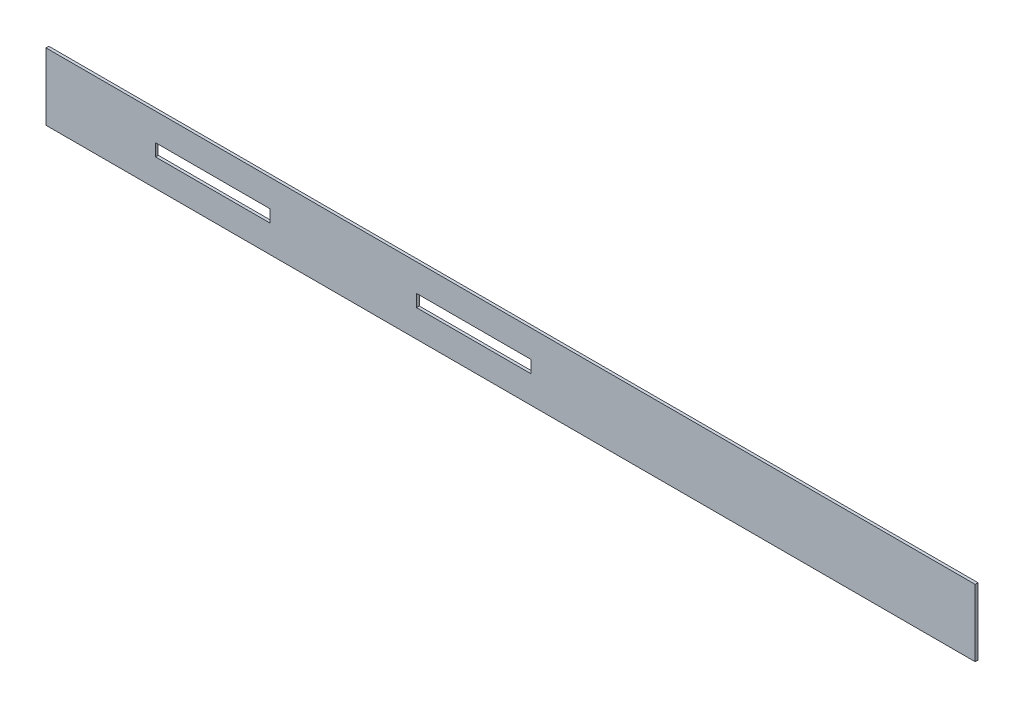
ISO-10303-21;
HEADER;
FILE_DESCRIPTION(('STEP AP214'),'2;1');
FILE_NAME('part.step','',(''),(''),'','','');
FILE_SCHEMA(('AUTOMOTIVE_DESIGN { 1 0 10303 214 1 1 1 1 }'));
ENDSEC;
DATA;
#1=APPLICATION_CONTEXT('core data for automotive mechanical design processes');
#2=APPLICATION_PROTOCOL_DEFINITION('international standard','automotive_design',2000,#1);
#3=PRODUCT_CONTEXT('',#1,'mechanical');
#4=PRODUCT('Part','Part','',(#3));
#5=PRODUCT_RELATED_PRODUCT_CATEGORY('part','',(#4));
#6=PRODUCT_DEFINITION_FORMATION('','',#4);
#7=PRODUCT_DEFINITION_CONTEXT('part definition',#1,'design');
#8=PRODUCT_DEFINITION('design','',#6,#7);
#9=PRODUCT_DEFINITION_SHAPE('','',#8);
#10=(LENGTH_UNIT() NAMED_UNIT(*) SI_UNIT(.MILLI.,.METRE.));
#11=(NAMED_UNIT(*) PLANE_ANGLE_UNIT() SI_UNIT($,.RADIAN.));
#12=(NAMED_UNIT(*) SI_UNIT($,.STERADIAN.) SOLID_ANGLE_UNIT());
#13=UNCERTAINTY_MEASURE_WITH_UNIT(LENGTH_MEASURE(1.E-05),#10,'distance_accuracy_value','');
#14=(GEOMETRIC_REPRESENTATION_CONTEXT(3) GLOBAL_UNCERTAINTY_ASSIGNED_CONTEXT((#13)) GLOBAL_UNIT_ASSIGNED_CONTEXT((#10,
#11,#12)) REPRESENTATION_CONTEXT('',''));
#15=CARTESIAN_POINT('',(0.,0.,0.));
#16=DIRECTION('',(0.,0.,1.));
#17=DIRECTION('',(1.,0.,0.));
#18=AXIS2_PLACEMENT_3D('',#15,#16,#17);
#19=CARTESIAN_POINT('',(-1417.10462608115,404.534646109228,8.));
#20=DIRECTION('',(1.,0.,0.));
#21=DIRECTION('',(0.,0.,-1.));
#22=AXIS2_PLACEMENT_3D('',#19,#20,#21);
#23=PLANE('',#22);
#24=DIRECTION('',(0.,-1.,0.));
#25=VECTOR('',#24,1.);
#26=CARTESIAN_POINT('',(-1417.10462608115,404.534646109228,0.));
#27=LINE('',#26,#25);
#28=CARTESIAN_POINT('',(-1417.10462608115,404.534646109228,0.));
#29=VERTEX_POINT('',#28);
#30=CARTESIAN_POINT('',(-1417.10462608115,214.534646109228,0.));
#31=VERTEX_POINT('',#30);
#32=EDGE_CURVE('E181',#29,#31,#27,.T.);
#33=ORIENTED_EDGE('',*,*,#32,.T.);
#34=DIRECTION('',(0.,0.,-1.));
#35=VECTOR('',#34,1.);
#36=CARTESIAN_POINT('',(-1417.10462608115,214.534646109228,8.));
#37=LINE('',#36,#35);
#38=CARTESIAN_POINT('',(-1417.10462608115,214.534646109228,8.));
#39=VERTEX_POINT('',#38);
#40=EDGE_CURVE('E11',#39,#31,#37,.T.);
#41=ORIENTED_EDGE('',*,*,#40,.F.);
#42=DIRECTION('',(0.,-1.,0.));
#43=VECTOR('',#42,1.);
#44=CARTESIAN_POINT('',(-1417.10462608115,404.534646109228,8.));
#45=LINE('',#44,#43);
#46=CARTESIAN_POINT('',(-1417.10462608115,404.534646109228,8.));
#47=VERTEX_POINT('',#46);
#48=EDGE_CURVE('E188',#47,#39,#45,.T.);
#49=ORIENTED_EDGE('',*,*,#48,.F.);
#50=DIRECTION('',(0.,0.,-1.));
#51=VECTOR('',#50,1.);
#52=CARTESIAN_POINT('',(-1417.10462608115,404.534646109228,8.));
#53=LINE('',#52,#51);
#54=EDGE_CURVE('E198',#47,#29,#53,.T.);
#55=ORIENTED_EDGE('',*,*,#54,.T.);
#56=EDGE_LOOP('',(#33,#41,#49,#55));
#57=FACE_BOUND('',#56,.T.);
#58=ADVANCED_FACE('F31',(#57),#23,.F.);
#59=CARTESIAN_POINT('',(-1417.10462608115,214.534646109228,8.));
#60=DIRECTION('',(0.,1.,0.));
#61=DIRECTION('',(0.,0.,1.));
#62=AXIS2_PLACEMENT_3D('',#59,#60,#61);
#63=PLANE('',#62);
#64=DIRECTION('',(1.,0.,0.));
#65=VECTOR('',#64,1.);
#66=CARTESIAN_POINT('',(-1417.10462608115,214.534646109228,0.));
#67=LINE('',#66,#65);
#68=CARTESIAN_POINT('',(1215.89537391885,214.534646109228,0.));
#69=VERTEX_POINT('',#68);
#70=EDGE_CURVE('E201',#31,#69,#67,.T.);
#71=ORIENTED_EDGE('',*,*,#70,.T.);
#72=DIRECTION('',(0.,0.,-1.));
#73=VECTOR('',#72,1.);
#74=CARTESIAN_POINT('',(1215.89537391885,214.534646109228,8.));
#75=LINE('',#74,#73);
#76=CARTESIAN_POINT('',(1215.89537391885,214.534646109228,8.));
#77=VERTEX_POINT('',#76);
#78=EDGE_CURVE('E38',#77,#69,#75,.T.);
#79=ORIENTED_EDGE('',*,*,#78,.F.);
#80=DIRECTION('',(1.,0.,0.));
#81=VECTOR('',#80,1.);
#82=CARTESIAN_POINT('',(-1417.10462608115,214.534646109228,8.));
#83=LINE('',#82,#81);
#84=EDGE_CURVE('E191',#39,#77,#83,.T.);
#85=ORIENTED_EDGE('',*,*,#84,.F.);
#86=ORIENTED_EDGE('',*,*,#40,.T.);
#87=EDGE_LOOP('',(#71,#79,#85,#86));
#88=FACE_BOUND('',#87,.T.);
#89=ADVANCED_FACE('F230',(#88),#63,.F.);
#90=CARTESIAN_POINT('',(1215.89537391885,404.534646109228,8.));
#91=DIRECTION('',(-1.,0.,0.));
#92=DIRECTION('',(0.,0.,1.));
#93=AXIS2_PLACEMENT_3D('',#90,#91,#92);
#94=PLANE('',#93);
#95=DIRECTION('',(0.,1.,0.));
#96=VECTOR('',#95,1.);
#97=CARTESIAN_POINT('',(1215.89537391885,404.534646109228,0.));
#98=LINE('',#97,#96);
#99=CARTESIAN_POINT('',(1215.89537391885,404.534646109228,0.));
#100=VERTEX_POINT('',#99);
#101=EDGE_CURVE('E203',#69,#100,#98,.T.);
#102=ORIENTED_EDGE('',*,*,#101,.T.);
#103=DIRECTION('',(0.,0.,-1.));
#104=VECTOR('',#103,1.);
#105=CARTESIAN_POINT('',(1215.89537391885,404.534646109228,8.));
#106=LINE('',#105,#104);
#107=CARTESIAN_POINT('',(1215.89537391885,404.534646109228,8.));
#108=VERTEX_POINT('',#107);
#109=EDGE_CURVE('E208',#108,#100,#106,.T.);
#110=ORIENTED_EDGE('',*,*,#109,.F.);
#111=DIRECTION('',(0.,1.,0.));
#112=VECTOR('',#111,1.);
#113=CARTESIAN_POINT('',(1215.89537391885,404.534646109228,8.));
#114=LINE('',#113,#112);
#115=EDGE_CURVE('E194',#77,#108,#114,.T.);
#116=ORIENTED_EDGE('',*,*,#115,.F.);
#117=ORIENTED_EDGE('',*,*,#78,.T.);
#118=EDGE_LOOP('',(#102,#110,#116,#117));
#119=FACE_BOUND('',#118,.T.);
#120=ADVANCED_FACE('F215',(#119),#94,.F.);
#121=CARTESIAN_POINT('',(-1417.10462608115,404.534646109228,8.));
#122=DIRECTION('',(0.,-1.,0.));
#123=DIRECTION('',(0.,0.,-1.));
#124=AXIS2_PLACEMENT_3D('',#121,#122,#123);
#125=PLANE('',#124);
#126=DIRECTION('',(-1.,0.,0.));
#127=VECTOR('',#126,1.);
#128=CARTESIAN_POINT('',(-1417.10462608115,404.534646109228,0.));
#129=LINE('',#128,#127);
#130=EDGE_CURVE('E192',#100,#29,#129,.T.);
#131=ORIENTED_EDGE('',*,*,#130,.T.);
#132=ORIENTED_EDGE('',*,*,#54,.F.);
#133=DIRECTION('',(-1.,0.,0.));
#134=VECTOR('',#133,1.);
#135=CARTESIAN_POINT('',(-1417.10462608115,404.534646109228,8.));
#136=LINE('',#135,#134);
#137=EDGE_CURVE('E196',#108,#47,#136,.T.);
#138=ORIENTED_EDGE('',*,*,#137,.F.);
#139=ORIENTED_EDGE('',*,*,#109,.T.);
#140=EDGE_LOOP('',(#131,#132,#138,#139));
#141=FACE_BOUND('',#140,.T.);
#142=ADVANCED_FACE('F223',(#141),#125,.F.);
#143=CARTESIAN_POINT('',(-1417.10462608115,214.534646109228,8.));
#144=DIRECTION('',(0.,0.,1.));
#145=DIRECTION('',(1.,0.,0.));
#146=AXIS2_PLACEMENT_3D('',#143,#144,#145);
#147=PLANE('',#146);
#148=DIRECTION('',(0.,1.,0.));
#149=VECTOR('',#148,1.);
#150=CARTESIAN_POINT('',(-42.1046260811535,292.034646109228,8.));
#151=LINE('',#150,#149);
#152=CARTESIAN_POINT('',(-42.1046260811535,292.034646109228,8.));
#153=VERTEX_POINT('',#152);
#154=CARTESIAN_POINT('',(-42.1046260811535,327.034646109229,8.));
#155=VERTEX_POINT('',#154);
#156=EDGE_CURVE('E45',#153,#155,#151,.T.);
#157=ORIENTED_EDGE('',*,*,#156,.F.);
#158=DIRECTION('',(1.,0.,0.));
#159=VECTOR('',#158,1.);
#160=CARTESIAN_POINT('',(-42.1046260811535,292.034646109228,8.));
#161=LINE('',#160,#159);
#162=CARTESIAN_POINT('',(-367.104626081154,292.034646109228,8.));
#163=VERTEX_POINT('',#162);
#164=EDGE_CURVE('E137',#163,#153,#161,.T.);
#165=ORIENTED_EDGE('',*,*,#164,.F.);
#166=DIRECTION('',(0.,-1.,0.));
#167=VECTOR('',#166,1.);
#168=CARTESIAN_POINT('',(-367.104626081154,292.034646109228,8.));
#169=LINE('',#168,#167);
#170=CARTESIAN_POINT('',(-367.104626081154,327.034646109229,8.));
#171=VERTEX_POINT('',#170);
#172=EDGE_CURVE('E140',#171,#163,#169,.T.);
#173=ORIENTED_EDGE('',*,*,#172,.F.);
#174=DIRECTION('',(-1.,0.,0.));
#175=VECTOR('',#174,1.);
#176=CARTESIAN_POINT('',(-42.1046260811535,327.034646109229,8.));
#177=LINE('',#176,#175);
#178=EDGE_CURVE('E146',#155,#171,#177,.T.);
#179=ORIENTED_EDGE('',*,*,#178,.F.);
#180=EDGE_LOOP('',(#157,#165,#173,#179));
#181=FACE_BOUND('',#180,.T.);
#182=DIRECTION('',(0.,1.,0.));
#183=VECTOR('',#182,1.);
#184=CARTESIAN_POINT('',(-782.104626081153,327.034646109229,8.));
#185=LINE('',#184,#183);
#186=CARTESIAN_POINT('',(-782.104626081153,292.034646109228,8.));
#187=VERTEX_POINT('',#186);
#188=CARTESIAN_POINT('',(-782.104626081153,327.034646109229,8.));
#189=VERTEX_POINT('',#188);
#190=EDGE_CURVE('E152',#187,#189,#185,.T.);
#191=ORIENTED_EDGE('',*,*,#190,.F.);
#192=DIRECTION('',(1.,0.,0.));
#193=VECTOR('',#192,1.);
#194=CARTESIAN_POINT('',(-782.104626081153,292.034646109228,8.));
#195=LINE('',#194,#193);
#196=CARTESIAN_POINT('',(-1107.10462608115,292.034646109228,8.));
#197=VERTEX_POINT('',#196);
#198=EDGE_CURVE('E160',#197,#187,#195,.T.);
#199=ORIENTED_EDGE('',*,*,#198,.F.);
#200=DIRECTION('',(0.,-1.,0.));
#201=VECTOR('',#200,1.);
#202=CARTESIAN_POINT('',(-1107.10462608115,327.034646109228,8.));
#203=LINE('',#202,#201);
#204=CARTESIAN_POINT('',(-1107.10462608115,327.034646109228,8.));
#205=VERTEX_POINT('',#204);
#206=EDGE_CURVE('E174',#205,#197,#203,.T.);
#207=ORIENTED_EDGE('',*,*,#206,.F.);
#208=DIRECTION('',(-1.,0.,0.));
#209=VECTOR('',#208,1.);
#210=CARTESIAN_POINT('',(-782.104626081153,327.034646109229,8.));
#211=LINE('',#210,#209);
#212=EDGE_CURVE('E171',#189,#205,#211,.T.);
#213=ORIENTED_EDGE('',*,*,#212,.F.);
#214=EDGE_LOOP('',(#191,#199,#207,#213));
#215=FACE_BOUND('',#214,.T.);
#216=ORIENTED_EDGE('',*,*,#48,.T.);
#217=ORIENTED_EDGE('',*,*,#84,.T.);
#218=ORIENTED_EDGE('',*,*,#115,.T.);
#219=ORIENTED_EDGE('',*,*,#137,.T.);
#220=EDGE_LOOP('',(#216,#217,#218,#219));
#221=FACE_BOUND('',#220,.T.);
#222=ADVANCED_FACE('F229',(#181,#215,#221),#147,.T.);
#223=CARTESIAN_POINT('',(-1417.10462608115,214.534646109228,0.));
#224=DIRECTION('',(0.,0.,1.));
#225=DIRECTION('',(1.,0.,0.));
#226=AXIS2_PLACEMENT_3D('',#223,#224,#225);
#227=PLANE('',#226);
#228=DIRECTION('',(1.,0.,0.));
#229=VECTOR('',#228,1.);
#230=CARTESIAN_POINT('',(-42.1046260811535,292.034646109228,0.));
#231=LINE('',#230,#229);
#232=CARTESIAN_POINT('',(-367.104626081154,292.034646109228,0.));
#233=VERTEX_POINT('',#232);
#234=CARTESIAN_POINT('',(-42.1046260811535,292.034646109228,0.));
#235=VERTEX_POINT('',#234);
#236=EDGE_CURVE('E127',#233,#235,#231,.T.);
#237=ORIENTED_EDGE('',*,*,#236,.T.);
#238=DIRECTION('',(0.,1.,0.));
#239=VECTOR('',#238,1.);
#240=CARTESIAN_POINT('',(-42.1046260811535,292.034646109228,0.));
#241=LINE('',#240,#239);
#242=CARTESIAN_POINT('',(-42.1046260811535,327.034646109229,0.));
#243=VERTEX_POINT('',#242);
#244=EDGE_CURVE('E121',#235,#243,#241,.T.);
#245=ORIENTED_EDGE('',*,*,#244,.T.);
#246=DIRECTION('',(-1.,0.,0.));
#247=VECTOR('',#246,1.);
#248=CARTESIAN_POINT('',(-42.1046260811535,327.034646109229,0.));
#249=LINE('',#248,#247);
#250=CARTESIAN_POINT('',(-367.104626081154,327.034646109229,0.));
#251=VERTEX_POINT('',#250);
#252=EDGE_CURVE('E130',#243,#251,#249,.T.);
#253=ORIENTED_EDGE('',*,*,#252,.T.);
#254=DIRECTION('',(0.,-1.,0.));
#255=VECTOR('',#254,1.);
#256=CARTESIAN_POINT('',(-367.104626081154,292.034646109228,0.));
#257=LINE('',#256,#255);
#258=EDGE_CURVE('E53',#251,#233,#257,.T.);
#259=ORIENTED_EDGE('',*,*,#258,.T.);
#260=EDGE_LOOP('',(#237,#245,#253,#259));
#261=FACE_BOUND('',#260,.T.);
#262=DIRECTION('',(1.,0.,0.));
#263=VECTOR('',#262,1.);
#264=CARTESIAN_POINT('',(-782.104626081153,292.034646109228,0.));
#265=LINE('',#264,#263);
#266=CARTESIAN_POINT('',(-1107.10462608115,292.034646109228,0.));
#267=VERTEX_POINT('',#266);
#268=CARTESIAN_POINT('',(-782.104626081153,292.034646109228,0.));
#269=VERTEX_POINT('',#268);
#270=EDGE_CURVE('E166',#267,#269,#265,.T.);
#271=ORIENTED_EDGE('',*,*,#270,.T.);
#272=DIRECTION('',(0.,1.,0.));
#273=VECTOR('',#272,1.);
#274=CARTESIAN_POINT('',(-782.104626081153,327.034646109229,0.));
#275=LINE('',#274,#273);
#276=CARTESIAN_POINT('',(-782.104626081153,327.034646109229,0.));
#277=VERTEX_POINT('',#276);
#278=EDGE_CURVE('E156',#269,#277,#275,.T.);
#279=ORIENTED_EDGE('',*,*,#278,.T.);
#280=DIRECTION('',(-1.,0.,0.));
#281=VECTOR('',#280,1.);
#282=CARTESIAN_POINT('',(-782.104626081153,327.034646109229,0.));
#283=LINE('',#282,#281);
#284=CARTESIAN_POINT('',(-1107.10462608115,327.034646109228,0.));
#285=VERTEX_POINT('',#284);
#286=EDGE_CURVE('E159',#277,#285,#283,.T.);
#287=ORIENTED_EDGE('',*,*,#286,.T.);
#288=DIRECTION('',(0.,-1.,0.));
#289=VECTOR('',#288,1.);
#290=CARTESIAN_POINT('',(-1107.10462608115,327.034646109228,0.));
#291=LINE('',#290,#289);
#292=EDGE_CURVE('E163',#285,#267,#291,.T.);
#293=ORIENTED_EDGE('',*,*,#292,.T.);
#294=EDGE_LOOP('',(#271,#279,#287,#293));
#295=FACE_BOUND('',#294,.T.);
#296=ORIENTED_EDGE('',*,*,#32,.F.);
#297=ORIENTED_EDGE('',*,*,#130,.F.);
#298=ORIENTED_EDGE('',*,*,#101,.F.);
#299=ORIENTED_EDGE('',*,*,#70,.F.);
#300=EDGE_LOOP('',(#296,#297,#298,#299));
#301=FACE_BOUND('',#300,.T.);
#302=ADVANCED_FACE('F134',(#261,#295,#301),#227,.F.);
#303=CARTESIAN_POINT('',(-782.104626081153,327.034646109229,0.));
#304=DIRECTION('',(1.,0.,0.));
#305=DIRECTION('',(0.,0.,-1.));
#306=AXIS2_PLACEMENT_3D('',#303,#304,#305);
#307=PLANE('',#306);
#308=ORIENTED_EDGE('',*,*,#190,.T.);
#309=DIRECTION('',(0.,0.,1.));
#310=VECTOR('',#309,1.);
#311=CARTESIAN_POINT('',(-782.104626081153,327.034646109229,0.));
#312=LINE('',#311,#310);
#313=EDGE_CURVE('E169',#277,#189,#312,.T.);
#314=ORIENTED_EDGE('',*,*,#313,.F.);
#315=ORIENTED_EDGE('',*,*,#278,.F.);
#316=DIRECTION('',(0.,0.,1.));
#317=VECTOR('',#316,1.);
#318=CARTESIAN_POINT('',(-782.104626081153,292.034646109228,0.));
#319=LINE('',#318,#317);
#320=EDGE_CURVE('E179',#269,#187,#319,.T.);
#321=ORIENTED_EDGE('',*,*,#320,.T.);
#322=EDGE_LOOP('',(#308,#314,#315,#321));
#323=FACE_BOUND('',#322,.T.);
#324=ADVANCED_FACE('F242',(#323),#307,.F.);
#325=CARTESIAN_POINT('',(-782.104626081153,292.034646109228,0.));
#326=DIRECTION('',(0.,-1.,0.));
#327=DIRECTION('',(0.,0.,-1.));
#328=AXIS2_PLACEMENT_3D('',#325,#326,#327);
#329=PLANE('',#328);
#330=ORIENTED_EDGE('',*,*,#198,.T.);
#331=ORIENTED_EDGE('',*,*,#320,.F.);
#332=ORIENTED_EDGE('',*,*,#270,.F.);
#333=DIRECTION('',(0.,0.,1.));
#334=VECTOR('',#333,1.);
#335=CARTESIAN_POINT('',(-1107.10462608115,292.034646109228,0.));
#336=LINE('',#335,#334);
#337=EDGE_CURVE('E182',#267,#197,#336,.T.);
#338=ORIENTED_EDGE('',*,*,#337,.T.);
#339=EDGE_LOOP('',(#330,#331,#332,#338));
#340=FACE_BOUND('',#339,.T.);
#341=ADVANCED_FACE('F248',(#340),#329,.F.);
#342=CARTESIAN_POINT('',(-1107.10462608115,327.034646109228,0.));
#343=DIRECTION('',(-1.,0.,0.));
#344=DIRECTION('',(0.,0.,1.));
#345=AXIS2_PLACEMENT_3D('',#342,#343,#344);
#346=PLANE('',#345);
#347=ORIENTED_EDGE('',*,*,#206,.T.);
#348=ORIENTED_EDGE('',*,*,#337,.F.);
#349=ORIENTED_EDGE('',*,*,#292,.F.);
#350=DIRECTION('',(0.,0.,1.));
#351=VECTOR('',#350,1.);
#352=CARTESIAN_POINT('',(-1107.10462608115,327.034646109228,0.));
#353=LINE('',#352,#351);
#354=EDGE_CURVE('E184',#285,#205,#353,.T.);
#355=ORIENTED_EDGE('',*,*,#354,.T.);
#356=EDGE_LOOP('',(#347,#348,#349,#355));
#357=FACE_BOUND('',#356,.T.);
#358=ADVANCED_FACE('F253',(#357),#346,.F.);
#359=CARTESIAN_POINT('',(-782.104626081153,327.034646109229,0.));
#360=DIRECTION('',(0.,1.,0.));
#361=DIRECTION('',(-1.,0.,0.));
#362=AXIS2_PLACEMENT_3D('',#359,#360,#361);
#363=PLANE('',#362);
#364=ORIENTED_EDGE('',*,*,#212,.T.);
#365=ORIENTED_EDGE('',*,*,#354,.F.);
#366=ORIENTED_EDGE('',*,*,#286,.F.);
#367=ORIENTED_EDGE('',*,*,#313,.T.);
#368=EDGE_LOOP('',(#364,#365,#366,#367));
#369=FACE_BOUND('',#368,.T.);
#370=ADVANCED_FACE('F250',(#369),#363,.F.);
#371=CARTESIAN_POINT('',(-42.1046260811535,292.034646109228,0.));
#372=DIRECTION('',(1.,0.,0.));
#373=DIRECTION('',(0.,1.,0.));
#374=AXIS2_PLACEMENT_3D('',#371,#372,#373);
#375=PLANE('',#374);
#376=ORIENTED_EDGE('',*,*,#156,.T.);
#377=DIRECTION('',(0.,0.,1.));
#378=VECTOR('',#377,1.);
#379=CARTESIAN_POINT('',(-42.1046260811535,327.034646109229,0.));
#380=LINE('',#379,#378);
#381=EDGE_CURVE('E117',#243,#155,#380,.T.);
#382=ORIENTED_EDGE('',*,*,#381,.F.);
#383=ORIENTED_EDGE('',*,*,#244,.F.);
#384=DIRECTION('',(0.,0.,1.));
#385=VECTOR('',#384,1.);
#386=CARTESIAN_POINT('',(-42.1046260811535,292.034646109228,0.));
#387=LINE('',#386,#385);
#388=EDGE_CURVE('E150',#235,#153,#387,.T.);
#389=ORIENTED_EDGE('',*,*,#388,.T.);
#390=EDGE_LOOP('',(#376,#382,#383,#389));
#391=FACE_BOUND('',#390,.T.);
#392=ADVANCED_FACE('F119',(#391),#375,.F.);
#393=CARTESIAN_POINT('',(-42.1046260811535,292.034646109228,0.));
#394=DIRECTION('',(0.,-1.,0.));
#395=DIRECTION('',(1.,0.,0.));
#396=AXIS2_PLACEMENT_3D('',#393,#394,#395);
#397=PLANE('',#396);
#398=ORIENTED_EDGE('',*,*,#164,.T.);
#399=ORIENTED_EDGE('',*,*,#388,.F.);
#400=ORIENTED_EDGE('',*,*,#236,.F.);
#401=DIRECTION('',(0.,0.,1.));
#402=VECTOR('',#401,1.);
#403=CARTESIAN_POINT('',(-367.104626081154,292.034646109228,0.));
#404=LINE('',#403,#402);
#405=EDGE_CURVE('E153',#233,#163,#404,.T.);
#406=ORIENTED_EDGE('',*,*,#405,.T.);
#407=EDGE_LOOP('',(#398,#399,#400,#406));
#408=FACE_BOUND('',#407,.T.);
#409=ADVANCED_FACE('F263',(#408),#397,.F.);
#410=CARTESIAN_POINT('',(-367.104626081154,292.034646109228,0.));
#411=DIRECTION('',(-1.,0.,0.));
#412=DIRECTION('',(0.,0.,1.));
#413=AXIS2_PLACEMENT_3D('',#410,#411,#412);
#414=PLANE('',#413);
#415=ORIENTED_EDGE('',*,*,#172,.T.);
#416=ORIENTED_EDGE('',*,*,#405,.F.);
#417=ORIENTED_EDGE('',*,*,#258,.F.);
#418=DIRECTION('',(0.,0.,1.));
#419=VECTOR('',#418,1.);
#420=CARTESIAN_POINT('',(-367.104626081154,327.034646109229,0.));
#421=LINE('',#420,#419);
#422=EDGE_CURVE('E126',#251,#171,#421,.T.);
#423=ORIENTED_EDGE('',*,*,#422,.T.);
#424=EDGE_LOOP('',(#415,#416,#417,#423));
#425=FACE_BOUND('',#424,.T.);
#426=ADVANCED_FACE('F266',(#425),#414,.F.);
#427=CARTESIAN_POINT('',(-42.1046260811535,327.034646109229,0.));
#428=DIRECTION('',(0.,1.,0.));
#429=DIRECTION('',(0.,0.,1.));
#430=AXIS2_PLACEMENT_3D('',#427,#428,#429);
#431=PLANE('',#430);
#432=ORIENTED_EDGE('',*,*,#178,.T.);
#433=ORIENTED_EDGE('',*,*,#422,.F.);
#434=ORIENTED_EDGE('',*,*,#252,.F.);
#435=ORIENTED_EDGE('',*,*,#381,.T.);
#436=EDGE_LOOP('',(#432,#433,#434,#435));
#437=FACE_BOUND('',#436,.T.);
#438=ADVANCED_FACE('F131',(#437),#431,.F.);
#439=CLOSED_SHELL('',(#58,#89,#120,#142,#222,#302,#324,#341,#358,#370,#392,#409,#426,#438));
#440=MANIFOLD_SOLID_BREP('B2',#439);
#441=ADVANCED_BREP_SHAPE_REPRESENTATION('',(#18,#440),#14);
#442=SHAPE_DEFINITION_REPRESENTATION(#9,#441);
ENDSEC;
END-ISO-10303-21;
